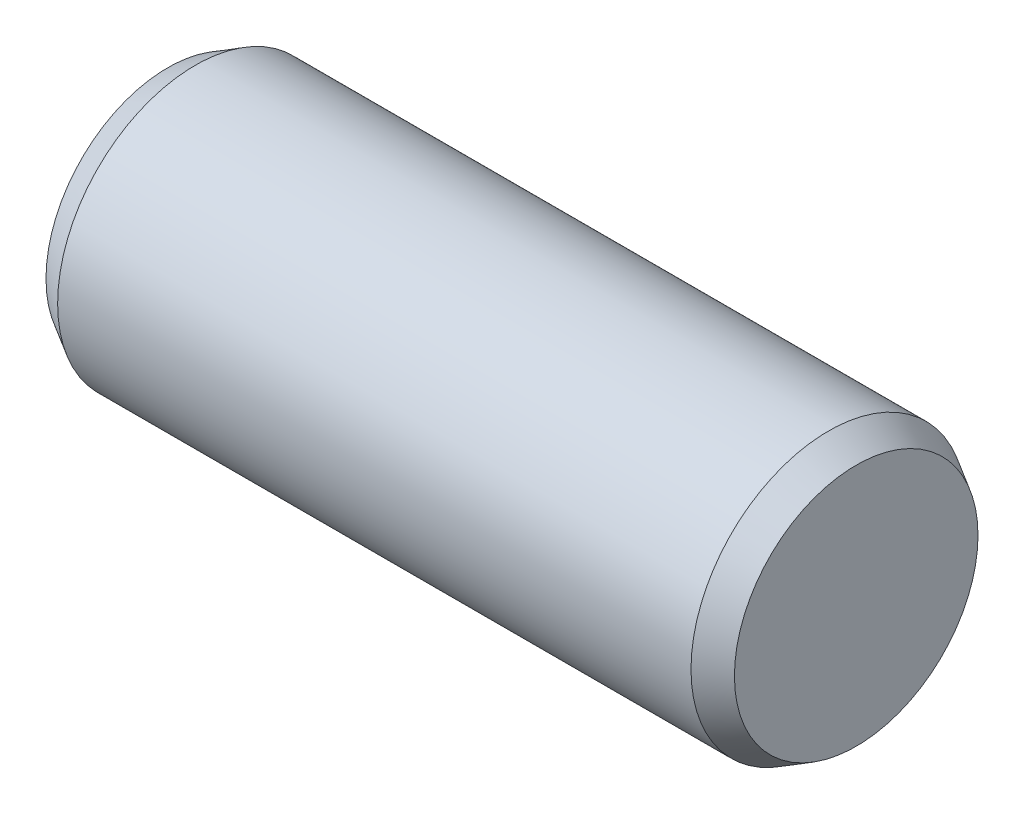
ISO-10303-21;
HEADER;
FILE_DESCRIPTION(('STEP AP214'),'2;1');
FILE_NAME('part.step','',(''),(''),'','','');
FILE_SCHEMA(('AUTOMOTIVE_DESIGN { 1 0 10303 214 1 1 1 1 }'));
ENDSEC;
DATA;
#1=APPLICATION_CONTEXT('core data for automotive mechanical design processes');
#2=APPLICATION_PROTOCOL_DEFINITION('international standard','automotive_design',2000,#1);
#3=PRODUCT_CONTEXT('',#1,'mechanical');
#4=PRODUCT('Part','Part','',(#3));
#5=PRODUCT_RELATED_PRODUCT_CATEGORY('part','',(#4));
#6=PRODUCT_DEFINITION_FORMATION('','',#4);
#7=PRODUCT_DEFINITION_CONTEXT('part definition',#1,'design');
#8=PRODUCT_DEFINITION('design','',#6,#7);
#9=PRODUCT_DEFINITION_SHAPE('','',#8);
#10=(LENGTH_UNIT() NAMED_UNIT(*) SI_UNIT(.MILLI.,.METRE.));
#11=(NAMED_UNIT(*) PLANE_ANGLE_UNIT() SI_UNIT($,.RADIAN.));
#12=(NAMED_UNIT(*) SI_UNIT($,.STERADIAN.) SOLID_ANGLE_UNIT());
#13=UNCERTAINTY_MEASURE_WITH_UNIT(LENGTH_MEASURE(1.E-05),#10,'distance_accuracy_value','');
#14=(GEOMETRIC_REPRESENTATION_CONTEXT(3) GLOBAL_UNCERTAINTY_ASSIGNED_CONTEXT((#13)) GLOBAL_UNIT_ASSIGNED_CONTEXT((#10,
#11,#12)) REPRESENTATION_CONTEXT('',''));
#15=CARTESIAN_POINT('',(0.,0.,0.));
#16=DIRECTION('',(0.,0.,1.));
#17=DIRECTION('',(1.,0.,0.));
#18=AXIS2_PLACEMENT_3D('',#15,#16,#17);
#19=CARTESIAN_POINT('',(0.,0.,0.));
#20=DIRECTION('',(1.,0.,0.));
#21=DIRECTION('',(0.,0.,-1.));
#22=AXIS2_PLACEMENT_3D('',#19,#20,#21);
#23=PLANE('',#22);
#24=CARTESIAN_POINT('',(0.,0.,0.));
#25=DIRECTION('',(-1.,0.,0.));
#26=DIRECTION('',(0.,0.,1.));
#27=AXIS2_PLACEMENT_3D('',#24,#25,#26);
#28=CIRCLE('',#27,17.6905989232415);
#29=CARTESIAN_POINT('',(0.,0.,17.6905989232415));
#30=VERTEX_POINT('',#29);
#31=EDGE_CURVE('E10',#30,#30,#28,.T.);
#32=ORIENTED_EDGE('',*,*,#31,.T.);
#33=EDGE_LOOP('',(#32));
#34=FACE_BOUND('',#33,.T.);
#35=ADVANCED_FACE('F31',(#34),#23,.F.);
#36=CARTESIAN_POINT('',(4.,0.,0.));
#37=DIRECTION('',(1.,0.,0.));
#38=DIRECTION('',(0.,0.,-1.));
#39=AXIS2_PLACEMENT_3D('',#36,#37,#38);
#40=CONICAL_SURFACE('',#39,20.,0.523598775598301);
#41=ORIENTED_EDGE('',*,*,#31,.F.);
#42=EDGE_LOOP('',(#41));
#43=FACE_BOUND('',#42,.T.);
#44=CARTESIAN_POINT('',(4.,0.,0.));
#45=DIRECTION('',(-1.,0.,0.));
#46=DIRECTION('',(0.,0.,1.));
#47=AXIS2_PLACEMENT_3D('',#44,#45,#46);
#48=CIRCLE('',#47,20.);
#49=CARTESIAN_POINT('',(4.,0.,20.));
#50=VERTEX_POINT('',#49);
#51=EDGE_CURVE('E37',#50,#50,#48,.T.);
#52=ORIENTED_EDGE('',*,*,#51,.T.);
#53=EDGE_LOOP('',(#52));
#54=FACE_BOUND('',#53,.T.);
#55=ADVANCED_FACE('F63',(#43,#54),#40,.T.);
#56=CARTESIAN_POINT('',(0.,0.,0.));
#57=DIRECTION('',(-1.,0.,0.));
#58=DIRECTION('',(0.,0.,1.));
#59=AXIS2_PLACEMENT_3D('',#56,#57,#58);
#60=CYLINDRICAL_SURFACE('',#59,20.);
#61=ORIENTED_EDGE('',*,*,#51,.F.);
#62=EDGE_LOOP('',(#61));
#63=FACE_BOUND('',#62,.T.);
#64=CARTESIAN_POINT('',(96.,0.,0.));
#65=DIRECTION('',(-1.,0.,0.));
#66=DIRECTION('',(0.,0.,1.));
#67=AXIS2_PLACEMENT_3D('',#64,#65,#66);
#68=CIRCLE('',#67,20.);
#69=CARTESIAN_POINT('',(96.,0.,20.));
#70=VERTEX_POINT('',#69);
#71=EDGE_CURVE('E41',#70,#70,#68,.T.);
#72=ORIENTED_EDGE('',*,*,#71,.T.);
#73=EDGE_LOOP('',(#72));
#74=FACE_BOUND('',#73,.T.);
#75=ADVANCED_FACE('F59',(#63,#74),#60,.T.);
#76=CARTESIAN_POINT('',(100.,0.,0.));
#77=DIRECTION('',(-1.,0.,0.));
#78=DIRECTION('',(0.,0.,1.));
#79=AXIS2_PLACEMENT_3D('',#76,#77,#78);
#80=CONICAL_SURFACE('',#79,17.6905989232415,0.5235987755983);
#81=ORIENTED_EDGE('',*,*,#71,.F.);
#82=EDGE_LOOP('',(#81));
#83=FACE_BOUND('',#82,.T.);
#84=CARTESIAN_POINT('',(100.,0.,0.));
#85=DIRECTION('',(-1.,0.,0.));
#86=DIRECTION('',(0.,0.,1.));
#87=AXIS2_PLACEMENT_3D('',#84,#85,#86);
#88=CIRCLE('',#87,17.6905989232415);
#89=CARTESIAN_POINT('',(100.,0.,17.6905989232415));
#90=VERTEX_POINT('',#89);
#91=EDGE_CURVE('E45',#90,#90,#88,.T.);
#92=ORIENTED_EDGE('',*,*,#91,.T.);
#93=EDGE_LOOP('',(#92));
#94=FACE_BOUND('',#93,.T.);
#95=ADVANCED_FACE('F51',(#83,#94),#80,.T.);
#96=CARTESIAN_POINT('',(100.,17.6905989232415,0.));
#97=DIRECTION('',(-1.,0.,0.));
#98=DIRECTION('',(0.,0.,1.));
#99=AXIS2_PLACEMENT_3D('',#96,#97,#98);
#100=PLANE('',#99);
#101=ORIENTED_EDGE('',*,*,#91,.F.);
#102=EDGE_LOOP('',(#101));
#103=FACE_BOUND('',#102,.T.);
#104=ADVANCED_FACE('F53',(#103),#100,.F.);
#105=CLOSED_SHELL('',(#35,#55,#75,#95,#104));
#106=MANIFOLD_SOLID_BREP('B2',#105);
#107=ADVANCED_BREP_SHAPE_REPRESENTATION('',(#18,#106),#14);
#108=SHAPE_DEFINITION_REPRESENTATION(#9,#107);
ENDSEC;
END-ISO-10303-21;
